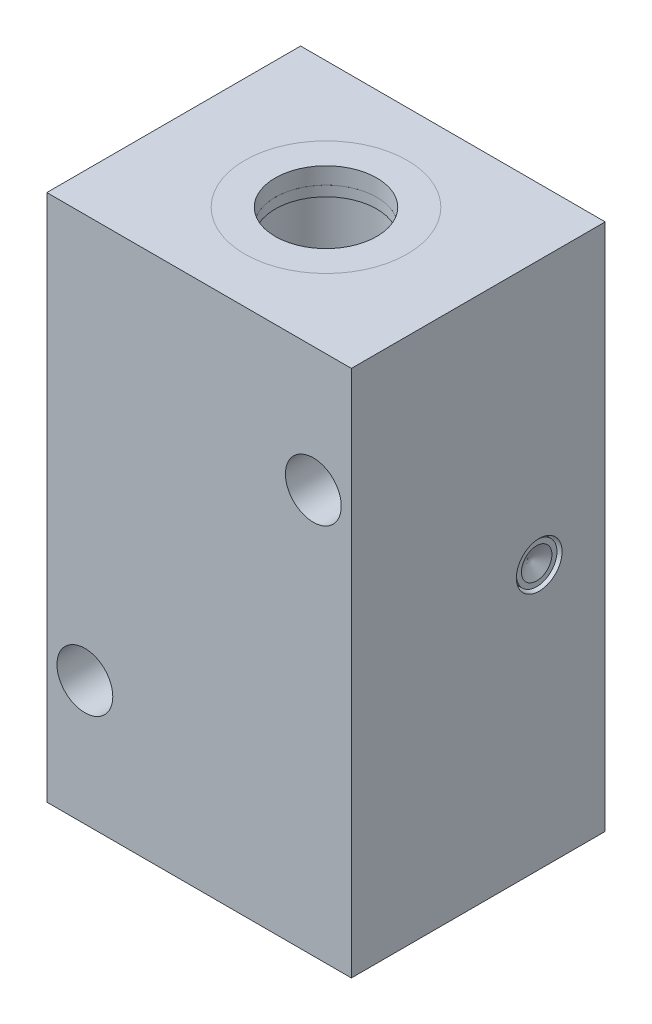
ISO-10303-21;
HEADER;
FILE_DESCRIPTION(('STEP AP214'),'2;1');
FILE_NAME('part.step','',(''),(''),'','','');
FILE_SCHEMA(('AUTOMOTIVE_DESIGN { 1 0 10303 214 1 1 1 1 }'));
ENDSEC;
DATA;
#1=APPLICATION_CONTEXT('core data for automotive mechanical design processes');
#2=APPLICATION_PROTOCOL_DEFINITION('international standard','automotive_design',2000,#1);
#3=PRODUCT_CONTEXT('',#1,'mechanical');
#4=PRODUCT('Part','Part','',(#3));
#5=PRODUCT_RELATED_PRODUCT_CATEGORY('part','',(#4));
#6=PRODUCT_DEFINITION_FORMATION('','',#4);
#7=PRODUCT_DEFINITION_CONTEXT('part definition',#1,'design');
#8=PRODUCT_DEFINITION('design','',#6,#7);
#9=PRODUCT_DEFINITION_SHAPE('','',#8);
#10=(LENGTH_UNIT() NAMED_UNIT(*) SI_UNIT(.MILLI.,.METRE.));
#11=(NAMED_UNIT(*) PLANE_ANGLE_UNIT() SI_UNIT($,.RADIAN.));
#12=(NAMED_UNIT(*) SI_UNIT($,.STERADIAN.) SOLID_ANGLE_UNIT());
#13=UNCERTAINTY_MEASURE_WITH_UNIT(LENGTH_MEASURE(1.E-05),#10,'distance_accuracy_value','');
#14=(GEOMETRIC_REPRESENTATION_CONTEXT(3) GLOBAL_UNCERTAINTY_ASSIGNED_CONTEXT((#13)) GLOBAL_UNIT_ASSIGNED_CONTEXT((#10,
#11,#12)) REPRESENTATION_CONTEXT('',''));
#15=CARTESIAN_POINT('',(0.,0.,0.));
#16=DIRECTION('',(0.,0.,1.));
#17=DIRECTION('',(1.,0.,0.));
#18=AXIS2_PLACEMENT_3D('',#15,#16,#17);
#19=CARTESIAN_POINT('',(1.88737914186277E-12,-48.6999999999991,0.));
#20=DIRECTION('',(0.,-1.,0.));
#21=DIRECTION('',(0.,0.,-1.));
#22=AXIS2_PLACEMENT_3D('',#19,#20,#21);
#23=PLANE('',#22);
#24=CARTESIAN_POINT('',(1.88737914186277E-12,-48.6999999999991,0.));
#25=DIRECTION('',(0.,-1.,0.));
#26=DIRECTION('',(0.,0.,-1.));
#27=AXIS2_PLACEMENT_3D('',#24,#25,#26);
#28=CIRCLE('',#27,16.);
#29=CARTESIAN_POINT('',(1.88737914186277E-12,-48.6999999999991,-16.));
#30=VERTEX_POINT('',#29);
#31=EDGE_CURVE('E65',#30,#30,#28,.T.);
#32=ORIENTED_EDGE('',*,*,#31,.F.);
#33=EDGE_LOOP('',(#32));
#34=FACE_BOUND('',#33,.T.);
#35=CARTESIAN_POINT('',(1.88737914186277E-12,-48.6999999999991,0.));
#36=DIRECTION('',(0.,-1.,0.));
#37=DIRECTION('',(0.,0.,-1.));
#38=AXIS2_PLACEMENT_3D('',#35,#36,#37);
#39=CIRCLE('',#38,10.);
#40=CARTESIAN_POINT('',(1.88737914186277E-12,-48.6999999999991,-10.));
#41=VERTEX_POINT('',#40);
#42=EDGE_CURVE('E77',#41,#41,#39,.T.);
#43=ORIENTED_EDGE('',*,*,#42,.T.);
#44=EDGE_LOOP('',(#43));
#45=FACE_BOUND('',#44,.T.);
#46=ADVANCED_FACE('F57',(#34,#45),#23,.F.);
#47=CARTESIAN_POINT('',(1.99840144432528E-12,-97.2548339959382,0.));
#48=DIRECTION('',(0.,1.,0.));
#49=DIRECTION('',(0.,0.,1.));
#50=AXIS2_PLACEMENT_3D('',#47,#48,#49);
#51=CYLINDRICAL_SURFACE('',#50,16.);
#52=CARTESIAN_POINT('',(1.88737914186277E-12,-51.9999999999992,0.));
#53=DIRECTION('',(0.,1.,0.));
#54=DIRECTION('',(0.,0.,1.));
#55=AXIS2_PLACEMENT_3D('',#52,#53,#54);
#56=CIRCLE('',#55,16.);
#57=CARTESIAN_POINT('',(1.88737914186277E-12,-51.9999999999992,16.));
#58=VERTEX_POINT('',#57);
#59=EDGE_CURVE('E71',#58,#58,#56,.T.);
#60=ORIENTED_EDGE('',*,*,#59,.T.);
#61=EDGE_LOOP('',(#60));
#62=FACE_BOUND('',#61,.T.);
#63=ORIENTED_EDGE('',*,*,#31,.T.);
#64=EDGE_LOOP('',(#63));
#65=FACE_BOUND('',#64,.T.);
#66=ADVANCED_FACE('F85',(#62,#65),#51,.T.);
#67=CARTESIAN_POINT('',(1.99840144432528E-12,-97.2548339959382,0.));
#68=DIRECTION('',(0.,1.,0.));
#69=DIRECTION('',(0.,0.,1.));
#70=AXIS2_PLACEMENT_3D('',#67,#68,#69);
#71=CYLINDRICAL_SURFACE('',#70,10.);
#72=CARTESIAN_POINT('',(1.88737914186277E-12,-51.9999999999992,0.));
#73=DIRECTION('',(0.,1.,0.));
#74=DIRECTION('',(0.,0.,1.));
#75=AXIS2_PLACEMENT_3D('',#72,#73,#74);
#76=CIRCLE('',#75,10.);
#77=CARTESIAN_POINT('',(1.88737914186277E-12,-51.9999999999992,10.));
#78=VERTEX_POINT('',#77);
#79=EDGE_CURVE('E11',#78,#78,#76,.T.);
#80=ORIENTED_EDGE('',*,*,#79,.F.);
#81=EDGE_LOOP('',(#80));
#82=FACE_BOUND('',#81,.T.);
#83=ORIENTED_EDGE('',*,*,#42,.F.);
#84=EDGE_LOOP('',(#83));
#85=FACE_BOUND('',#84,.T.);
#86=ADVANCED_FACE('F83',(#82,#85),#71,.F.);
#87=CARTESIAN_POINT('',(1.88737914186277E-12,-51.9999999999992,0.));
#88=DIRECTION('',(0.,1.,0.));
#89=DIRECTION('',(0.,0.,1.));
#90=AXIS2_PLACEMENT_3D('',#87,#88,#89);
#91=PLANE('',#90);
#92=ORIENTED_EDGE('',*,*,#79,.T.);
#93=EDGE_LOOP('',(#92));
#94=FACE_BOUND('',#93,.T.);
#95=ORIENTED_EDGE('',*,*,#59,.F.);
#96=EDGE_LOOP('',(#95));
#97=FACE_BOUND('',#96,.T.);
#98=ADVANCED_FACE('F59',(#94,#97),#91,.F.);
#99=CLOSED_SHELL('',(#46,#66,#86,#98));
#100=MANIFOLD_SOLID_BREP('B2',#99);
#101=CARTESIAN_POINT('',(0.,97.2548339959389,0.));
#102=DIRECTION('',(0.,-1.,0.));
#103=DIRECTION('',(1.,0.,0.));
#104=AXIS2_PLACEMENT_3D('',#101,#102,#103);
#105=CYLINDRICAL_SURFACE('',#104,16.);
#106=CARTESIAN_POINT('',(1.11022302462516E-13,48.7,0.));
#107=DIRECTION('',(0.,1.,0.));
#108=DIRECTION('',(-1.,0.,0.));
#109=AXIS2_PLACEMENT_3D('',#106,#107,#108);
#110=CIRCLE('',#109,16.);
#111=CARTESIAN_POINT('',(-15.9999999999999,48.7,0.));
#112=VERTEX_POINT('',#111);
#113=EDGE_CURVE('E143',#112,#112,#110,.T.);
#114=ORIENTED_EDGE('',*,*,#113,.T.);
#115=EDGE_LOOP('',(#114));
#116=FACE_BOUND('',#115,.T.);
#117=CARTESIAN_POINT('',(0.,51.9999999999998,0.));
#118=DIRECTION('',(0.,1.,0.));
#119=DIRECTION('',(0.,0.,1.));
#120=AXIS2_PLACEMENT_3D('',#117,#118,#119);
#121=CIRCLE('',#120,16.);
#122=CARTESIAN_POINT('',(0.,51.9999999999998,16.));
#123=VERTEX_POINT('',#122);
#124=EDGE_CURVE('E56',#123,#123,#121,.T.);
#125=ORIENTED_EDGE('',*,*,#124,.F.);
#126=EDGE_LOOP('',(#125));
#127=FACE_BOUND('',#126,.T.);
#128=ADVANCED_FACE('F135',(#116,#127),#105,.T.);
#129=CARTESIAN_POINT('',(1.11022302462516E-13,48.7,0.));
#130=DIRECTION('',(0.,1.,0.));
#131=DIRECTION('',(-1.,0.,0.));
#132=AXIS2_PLACEMENT_3D('',#129,#130,#131);
#133=PLANE('',#132);
#134=ORIENTED_EDGE('',*,*,#113,.F.);
#135=EDGE_LOOP('',(#134));
#136=FACE_BOUND('',#135,.T.);
#137=CARTESIAN_POINT('',(1.11022302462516E-13,48.7,0.));
#138=DIRECTION('',(0.,1.,0.));
#139=DIRECTION('',(-1.,0.,0.));
#140=AXIS2_PLACEMENT_3D('',#137,#138,#139);
#141=CIRCLE('',#140,10.);
#142=CARTESIAN_POINT('',(-9.99999999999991,48.7,0.));
#143=VERTEX_POINT('',#142);
#144=EDGE_CURVE('E150',#143,#143,#141,.T.);
#145=ORIENTED_EDGE('',*,*,#144,.T.);
#146=EDGE_LOOP('',(#145));
#147=FACE_BOUND('',#146,.T.);
#148=ADVANCED_FACE('F167',(#136,#147),#133,.F.);
#149=CARTESIAN_POINT('',(0.,97.2548339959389,0.));
#150=DIRECTION('',(0.,-1.,0.));
#151=DIRECTION('',(1.,0.,0.));
#152=AXIS2_PLACEMENT_3D('',#149,#150,#151);
#153=CYLINDRICAL_SURFACE('',#152,10.);
#154=ORIENTED_EDGE('',*,*,#144,.F.);
#155=EDGE_LOOP('',(#154));
#156=FACE_BOUND('',#155,.T.);
#157=CARTESIAN_POINT('',(0.,51.9999999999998,0.));
#158=DIRECTION('',(0.,1.,0.));
#159=DIRECTION('',(0.,0.,1.));
#160=AXIS2_PLACEMENT_3D('',#157,#158,#159);
#161=CIRCLE('',#160,10.);
#162=CARTESIAN_POINT('',(0.,51.9999999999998,10.));
#163=VERTEX_POINT('',#162);
#164=EDGE_CURVE('E138',#163,#163,#161,.T.);
#165=ORIENTED_EDGE('',*,*,#164,.T.);
#166=EDGE_LOOP('',(#165));
#167=FACE_BOUND('',#166,.T.);
#168=ADVANCED_FACE('F159',(#156,#167),#153,.F.);
#169=CARTESIAN_POINT('',(0.,51.9999999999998,0.));
#170=DIRECTION('',(0.,1.,0.));
#171=DIRECTION('',(0.,0.,1.));
#172=AXIS2_PLACEMENT_3D('',#169,#170,#171);
#173=PLANE('',#172);
#174=ORIENTED_EDGE('',*,*,#164,.F.);
#175=EDGE_LOOP('',(#174));
#176=FACE_BOUND('',#175,.T.);
#177=ORIENTED_EDGE('',*,*,#124,.T.);
#178=EDGE_LOOP('',(#177));
#179=FACE_BOUND('',#178,.T.);
#180=ADVANCED_FACE('F161',(#176,#179),#173,.T.);
#181=CLOSED_SHELL('',(#128,#148,#168,#180));
#182=MANIFOLD_SOLID_BREP('B6',#181);
#183=CARTESIAN_POINT('',(0.,5.69999999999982,0.));
#184=DIRECTION('',(0.,1.,0.));
#185=DIRECTION('',(0.,0.,1.));
#186=AXIS2_PLACEMENT_3D('',#183,#184,#185);
#187=CYLINDRICAL_SURFACE('',#186,10.5);
#188=CARTESIAN_POINT('',(0.,5.69999999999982,0.));
#189=DIRECTION('',(0.,1.,0.));
#190=DIRECTION('',(0.,0.,-1.));
#191=AXIS2_PLACEMENT_3D('',#188,#189,#190);
#192=CIRCLE('',#191,10.5);
#193=CARTESIAN_POINT('',(0.,5.69999999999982,-10.5));
#194=VERTEX_POINT('',#193);
#195=EDGE_CURVE('E562',#194,#194,#192,.T.);
#196=ORIENTED_EDGE('',*,*,#195,.F.);
#197=EDGE_LOOP('',(#196));
#198=FACE_BOUND('',#197,.T.);
#199=CARTESIAN_POINT('',(0.,46.6999999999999,0.));
#200=DIRECTION('',(0.,1.,0.));
#201=DIRECTION('',(0.,0.,-1.));
#202=AXIS2_PLACEMENT_3D('',#199,#200,#201);
#203=CIRCLE('',#202,10.5);
#204=CARTESIAN_POINT('',(0.,46.6999999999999,-10.5));
#205=VERTEX_POINT('',#204);
#206=EDGE_CURVE('E547',#205,#205,#203,.T.);
#207=ORIENTED_EDGE('',*,*,#206,.T.);
#208=EDGE_LOOP('',(#207));
#209=FACE_BOUND('',#208,.T.);
#210=ADVANCED_FACE('F204',(#198,#209),#187,.F.);
#211=CARTESIAN_POINT('',(0.,5.69999999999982,0.));
#212=DIRECTION('',(0.,-1.,0.));
#213=DIRECTION('',(0.,0.,-1.));
#214=AXIS2_PLACEMENT_3D('',#211,#212,#213);
#215=PLANE('',#214);
#216=CARTESIAN_POINT('',(0.,5.69999999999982,0.));
#217=DIRECTION('',(0.,-1.,0.));
#218=DIRECTION('',(0.,0.,-1.));
#219=AXIS2_PLACEMENT_3D('',#216,#217,#218);
#220=CIRCLE('',#219,10.);
#221=CARTESIAN_POINT('',(0.,5.69999999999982,-10.));
#222=VERTEX_POINT('',#221);
#223=EDGE_CURVE('E336',#222,#222,#220,.T.);
#224=ORIENTED_EDGE('',*,*,#223,.T.);
#225=EDGE_LOOP('',(#224));
#226=FACE_BOUND('',#225,.T.);
#227=ORIENTED_EDGE('',*,*,#195,.T.);
#228=EDGE_LOOP('',(#227));
#229=FACE_BOUND('',#228,.T.);
#230=ADVANCED_FACE('F431',(#226,#229),#215,.F.);
#231=CARTESIAN_POINT('',(0.,46.6999999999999,0.));
#232=DIRECTION('',(0.,-1.,0.));
#233=DIRECTION('',(0.,0.,-1.));
#234=AXIS2_PLACEMENT_3D('',#231,#232,#233);
#235=PLANE('',#234);
#236=CARTESIAN_POINT('',(0.,46.6999999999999,0.));
#237=DIRECTION('',(0.,-1.,0.));
#238=DIRECTION('',(1.,0.,0.));
#239=AXIS2_PLACEMENT_3D('',#236,#237,#238);
#240=CIRCLE('',#239,10.);
#241=CARTESIAN_POINT('',(10.,46.6999999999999,0.));
#242=VERTEX_POINT('',#241);
#243=EDGE_CURVE('E537',#242,#242,#240,.T.);
#244=ORIENTED_EDGE('',*,*,#243,.F.);
#245=EDGE_LOOP('',(#244));
#246=FACE_BOUND('',#245,.T.);
#247=ORIENTED_EDGE('',*,*,#206,.F.);
#248=EDGE_LOOP('',(#247));
#249=FACE_BOUND('',#248,.T.);
#250=ADVANCED_FACE('F437',(#246,#249),#235,.T.);
#251=CARTESIAN_POINT('',(0.,51.9999999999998,0.));
#252=DIRECTION('',(0.,-1.,0.));
#253=DIRECTION('',(1.,0.,0.));
#254=AXIS2_PLACEMENT_3D('',#251,#252,#253);
#255=CYLINDRICAL_SURFACE('',#254,16.);
#256=CARTESIAN_POINT('',(0.,51.9999999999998,0.));
#257=DIRECTION('',(0.,-1.,0.));
#258=DIRECTION('',(1.,0.,0.));
#259=AXIS2_PLACEMENT_3D('',#256,#257,#258);
#260=CIRCLE('',#259,16.);
#261=CARTESIAN_POINT('',(16.,51.9999999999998,0.));
#262=VERTEX_POINT('',#261);
#263=EDGE_CURVE('E520',#262,#262,#260,.T.);
#264=ORIENTED_EDGE('',*,*,#263,.F.);
#265=EDGE_LOOP('',(#264));
#266=FACE_BOUND('',#265,.T.);
#267=CARTESIAN_POINT('',(1.11022302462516E-13,48.7,0.));
#268=DIRECTION('',(0.,-1.,0.));
#269=DIRECTION('',(1.,0.,0.));
#270=AXIS2_PLACEMENT_3D('',#267,#268,#269);
#271=CIRCLE('',#270,16.);
#272=CARTESIAN_POINT('',(16.0000000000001,48.7,0.));
#273=VERTEX_POINT('',#272);
#274=EDGE_CURVE('E283',#273,#273,#271,.T.);
#275=ORIENTED_EDGE('',*,*,#274,.T.);
#276=EDGE_LOOP('',(#275));
#277=FACE_BOUND('',#276,.T.);
#278=ADVANCED_FACE('F642',(#266,#277),#255,.F.);
#279=CARTESIAN_POINT('',(0.,51.9999999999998,0.));
#280=DIRECTION('',(0.,-1.,0.));
#281=DIRECTION('',(1.,0.,0.));
#282=AXIS2_PLACEMENT_3D('',#279,#280,#281);
#283=CYLINDRICAL_SURFACE('',#282,10.);
#284=CARTESIAN_POINT('',(1.11022302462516E-13,48.7,0.));
#285=DIRECTION('',(0.,-1.,0.));
#286=DIRECTION('',(1.,0.,0.));
#287=AXIS2_PLACEMENT_3D('',#284,#285,#286);
#288=CIRCLE('',#287,10.);
#289=CARTESIAN_POINT('',(10.0000000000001,48.7,0.));
#290=VERTEX_POINT('',#289);
#291=EDGE_CURVE('E536',#290,#290,#288,.T.);
#292=ORIENTED_EDGE('',*,*,#291,.F.);
#293=EDGE_LOOP('',(#292));
#294=FACE_BOUND('',#293,.T.);
#295=ORIENTED_EDGE('',*,*,#243,.T.);
#296=EDGE_LOOP('',(#295));
#297=FACE_BOUND('',#296,.T.);
#298=ADVANCED_FACE('F638',(#294,#297),#283,.F.);
#299=CARTESIAN_POINT('',(10.0000000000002,48.6999999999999,0.));
#300=DIRECTION('',(0.,-1.,0.));
#301=DIRECTION('',(1.,0.,0.));
#302=AXIS2_PLACEMENT_3D('',#299,#300,#301);
#303=PLANE('',#302);
#304=ORIENTED_EDGE('',*,*,#274,.F.);
#305=EDGE_LOOP('',(#304));
#306=FACE_BOUND('',#305,.T.);
#307=ORIENTED_EDGE('',*,*,#291,.T.);
#308=EDGE_LOOP('',(#307));
#309=FACE_BOUND('',#308,.T.);
#310=ADVANCED_FACE('F422',(#306,#309),#303,.F.);
#311=CARTESIAN_POINT('',(1.88737914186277E-12,-51.9999999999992,0.));
#312=DIRECTION('',(0.,1.,0.));
#313=DIRECTION('',(0.,0.,1.));
#314=AXIS2_PLACEMENT_3D('',#311,#312,#313);
#315=PLANE('',#314);
#316=DIRECTION('',(1.,0.,0.));
#317=VECTOR('',#316,1.);
#318=CARTESIAN_POINT('',(1.88737914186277E-12,-51.9999999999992,-25.));
#319=LINE('',#318,#317);
#320=CARTESIAN_POINT('',(30.0000000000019,-52.0000000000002,-25.0000000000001));
#321=VERTEX_POINT('',#320);
#322=CARTESIAN_POINT('',(-29.9999999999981,-51.9999999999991,-25.));
#323=VERTEX_POINT('',#322);
#324=EDGE_CURVE('E493',#321,#323,#319,.F.);
#325=ORIENTED_EDGE('',*,*,#324,.F.);
#326=DIRECTION('',(0.,0.,1.));
#327=VECTOR('',#326,1.);
#328=CARTESIAN_POINT('',(30.0000000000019,-51.9999999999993,0.));
#329=LINE('',#328,#327);
#330=CARTESIAN_POINT('',(30.0000000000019,-52.0000000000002,25.));
#331=VERTEX_POINT('',#330);
#332=EDGE_CURVE('E500',#331,#321,#329,.F.);
#333=ORIENTED_EDGE('',*,*,#332,.F.);
#334=DIRECTION('',(1.,0.,0.));
#335=VECTOR('',#334,1.);
#336=CARTESIAN_POINT('',(-21.9999999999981,-52.,25.));
#337=LINE('',#336,#335);
#338=CARTESIAN_POINT('',(-29.9999999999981,-52.,25.));
#339=VERTEX_POINT('',#338);
#340=EDGE_CURVE('E567',#339,#331,#337,.T.);
#341=ORIENTED_EDGE('',*,*,#340,.F.);
#342=DIRECTION('',(0.,0.,1.));
#343=VECTOR('',#342,1.);
#344=CARTESIAN_POINT('',(-29.9999999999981,-51.9999999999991,-19.));
#345=LINE('',#344,#343);
#346=EDGE_CURVE('E576',#323,#339,#345,.T.);
#347=ORIENTED_EDGE('',*,*,#346,.F.);
#348=EDGE_LOOP('',(#325,#333,#341,#347));
#349=FACE_BOUND('',#348,.T.);
#350=CARTESIAN_POINT('',(1.88737914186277E-12,-51.9999999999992,0.));
#351=DIRECTION('',(0.,-1.,0.));
#352=DIRECTION('',(0.,0.,-1.));
#353=AXIS2_PLACEMENT_3D('',#350,#351,#352);
#354=CIRCLE('',#353,16.);
#355=CARTESIAN_POINT('',(1.88737914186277E-12,-51.9999999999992,-16.));
#356=VERTEX_POINT('',#355);
#357=EDGE_CURVE('E320',#356,#356,#354,.T.);
#358=ORIENTED_EDGE('',*,*,#357,.F.);
#359=EDGE_LOOP('',(#358));
#360=FACE_BOUND('',#359,.T.);
#361=ADVANCED_FACE('F420',(#349,#360),#315,.F.);
#362=CARTESIAN_POINT('',(0.,51.9999999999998,0.));
#363=DIRECTION('',(0.,1.,0.));
#364=DIRECTION('',(0.,0.,1.));
#365=AXIS2_PLACEMENT_3D('',#362,#363,#364);
#366=PLANE('',#365);
#367=ORIENTED_EDGE('',*,*,#263,.T.);
#368=EDGE_LOOP('',(#367));
#369=FACE_BOUND('',#368,.T.);
#370=DIRECTION('',(0.,0.,1.));
#371=VECTOR('',#370,1.);
#372=CARTESIAN_POINT('',(30.0000000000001,52.,0.));
#373=LINE('',#372,#371);
#374=CARTESIAN_POINT('',(30.0000000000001,52.,25.));
#375=VERTEX_POINT('',#374);
#376=CARTESIAN_POINT('',(30.0000000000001,52.,-25.));
#377=VERTEX_POINT('',#376);
#378=EDGE_CURVE('E558',#375,#377,#373,.F.);
#379=ORIENTED_EDGE('',*,*,#378,.T.);
#380=DIRECTION('',(1.,0.,0.));
#381=VECTOR('',#380,1.);
#382=CARTESIAN_POINT('',(0.,51.9999999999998,-25.));
#383=LINE('',#382,#381);
#384=CARTESIAN_POINT('',(-30.,51.9999999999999,-25.));
#385=VERTEX_POINT('',#384);
#386=EDGE_CURVE('E529',#377,#385,#383,.F.);
#387=ORIENTED_EDGE('',*,*,#386,.T.);
#388=DIRECTION('',(0.,0.,-1.));
#389=VECTOR('',#388,1.);
#390=CARTESIAN_POINT('',(-30.,51.9999999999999,-25.));
#391=LINE('',#390,#389);
#392=CARTESIAN_POINT('',(-30.,51.9999999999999,25.));
#393=VERTEX_POINT('',#392);
#394=EDGE_CURVE('E524',#393,#385,#391,.T.);
#395=ORIENTED_EDGE('',*,*,#394,.F.);
#396=DIRECTION('',(1.,0.,0.));
#397=VECTOR('',#396,1.);
#398=CARTESIAN_POINT('',(-22.,51.9999999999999,25.));
#399=LINE('',#398,#397);
#400=EDGE_CURVE('E214',#375,#393,#399,.F.);
#401=ORIENTED_EDGE('',*,*,#400,.F.);
#402=EDGE_LOOP('',(#379,#387,#395,#401));
#403=FACE_BOUND('',#402,.T.);
#404=ADVANCED_FACE('F418',(#369,#403),#366,.T.);
#405=CARTESIAN_POINT('',(30.0000000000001,52.,7.79999999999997));
#406=DIRECTION('',(1.,0.,0.));
#407=DIRECTION('',(0.,1.,0.));
#408=AXIS2_PLACEMENT_3D('',#405,#406,#407);
#409=PLANE('',#408);
#410=CARTESIAN_POINT('',(30.,-2.22044604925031E-13,-12.));
#411=DIRECTION('',(1.,0.,0.));
#412=DIRECTION('',(0.,0.,-1.));
#413=AXIS2_PLACEMENT_3D('',#410,#411,#412);
#414=CIRCLE('',#413,4.50000000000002);
#415=CARTESIAN_POINT('',(30.,-2.22044604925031E-13,-16.5));
#416=VERTEX_POINT('',#415);
#417=EDGE_CURVE('E516',#416,#416,#414,.T.);
#418=ORIENTED_EDGE('',*,*,#417,.F.);
#419=EDGE_LOOP('',(#418));
#420=FACE_BOUND('',#419,.T.);
#421=ORIENTED_EDGE('',*,*,#332,.T.);
#422=DIRECTION('',(0.,-1.,0.));
#423=VECTOR('',#422,1.);
#424=CARTESIAN_POINT('',(30.0000000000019,-52.0000000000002,-25.0000000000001));
#425=LINE('',#424,#423);
#426=EDGE_CURVE('E489',#377,#321,#425,.T.);
#427=ORIENTED_EDGE('',*,*,#426,.F.);
#428=ORIENTED_EDGE('',*,*,#378,.F.);
#429=DIRECTION('',(0.,-1.,0.));
#430=VECTOR('',#429,1.);
#431=CARTESIAN_POINT('',(30.0000000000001,96.7213595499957,25.0000000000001));
#432=LINE('',#431,#430);
#433=EDGE_CURVE('E287',#375,#331,#432,.T.);
#434=ORIENTED_EDGE('',*,*,#433,.T.);
#435=EDGE_LOOP('',(#421,#427,#428,#434));
#436=FACE_BOUND('',#435,.T.);
#437=ADVANCED_FACE('F414',(#420,#436),#409,.T.);
#438=CARTESIAN_POINT('',(-19.0000000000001,51.9999999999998,-25.));
#439=DIRECTION('',(0.,0.,-1.));
#440=DIRECTION('',(-1.,0.,0.));
#441=AXIS2_PLACEMENT_3D('',#438,#439,#440);
#442=PLANE('',#441);
#443=ORIENTED_EDGE('',*,*,#426,.T.);
#444=ORIENTED_EDGE('',*,*,#324,.T.);
#445=DIRECTION('',(0.,-1.,0.));
#446=VECTOR('',#445,1.);
#447=CARTESIAN_POINT('',(-29.9999999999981,-51.9999999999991,-25.));
#448=LINE('',#447,#446);
#449=EDGE_CURVE('E564',#385,#323,#448,.T.);
#450=ORIENTED_EDGE('',*,*,#449,.F.);
#451=ORIENTED_EDGE('',*,*,#386,.F.);
#452=EDGE_LOOP('',(#443,#444,#450,#451));
#453=FACE_BOUND('',#452,.T.);
#454=CARTESIAN_POINT('',(-22.5,-27.499999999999,-24.9999999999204));
#455=DIRECTION('',(0.,0.,-1.));
#456=DIRECTION('',(0.,1.,0.));
#457=AXIS2_PLACEMENT_3D('',#454,#455,#456);
#458=CIRCLE('',#457,3.99900000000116);
#459=CARTESIAN_POINT('',(-26.4990000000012,-27.4999999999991,-24.9999999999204));
#460=VERTEX_POINT('',#459);
#461=CARTESIAN_POINT('',(-19.,-29.4344252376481,-24.999999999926));
#462=VERTEX_POINT('',#461);
#463=EDGE_CURVE('E491',#460,#462,#458,.F.);
#464=ORIENTED_EDGE('',*,*,#463,.T.);
#465=DIRECTION('',(0.,-1.,0.));
#466=VECTOR('',#465,1.);
#467=CARTESIAN_POINT('',(-19.0000000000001,96.7213595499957,-25.));
#468=LINE('',#467,#466);
#469=CARTESIAN_POINT('',(-18.9999999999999,-25.5655747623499,-24.999999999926));
#470=VERTEX_POINT('',#469);
#471=EDGE_CURVE('E288',#470,#462,#468,.T.);
#472=ORIENTED_EDGE('',*,*,#471,.F.);
#473=CARTESIAN_POINT('',(-22.5,-27.499999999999,-24.9999999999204));
#474=DIRECTION('',(0.,0.,-1.));
#475=DIRECTION('',(0.,1.,0.));
#476=AXIS2_PLACEMENT_3D('',#473,#474,#475);
#477=CIRCLE('',#476,3.99900000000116);
#478=EDGE_CURVE('E402',#470,#460,#477,.F.);
#479=ORIENTED_EDGE('',*,*,#478,.T.);
#480=EDGE_LOOP('',(#464,#472,#479));
#481=FACE_BOUND('',#480,.T.);
#482=DIRECTION('',(0.,-1.,0.));
#483=VECTOR('',#482,1.);
#484=CARTESIAN_POINT('',(19.,96.7213595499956,-25.));
#485=LINE('',#484,#483);
#486=CARTESIAN_POINT('',(19.0000000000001,29.4344252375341,-25.0000000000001));
#487=VERTEX_POINT('',#486);
#488=CARTESIAN_POINT('',(19.0000000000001,25.5655747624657,-25.0000000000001));
#489=VERTEX_POINT('',#488);
#490=EDGE_CURVE('E281',#487,#489,#485,.T.);
#491=ORIENTED_EDGE('',*,*,#490,.T.);
#492=CARTESIAN_POINT('',(22.5,27.5,-25.0000000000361));
#493=DIRECTION('',(0.,0.,-1.));
#494=DIRECTION('',(-1.,0.,0.));
#495=AXIS2_PLACEMENT_3D('',#492,#493,#494);
#496=CIRCLE('',#495,3.99899999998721);
#497=EDGE_CURVE('E271',#487,#489,#496,.T.);
#498=ORIENTED_EDGE('',*,*,#497,.F.);
#499=EDGE_LOOP('',(#491,#498));
#500=FACE_BOUND('',#499,.T.);
#501=ADVANCED_FACE('F285',(#453,#481,#500),#442,.T.);
#502=CARTESIAN_POINT('',(-22.5,-27.499999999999,-24.9999999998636));
#503=DIRECTION('',(0.,0.,-1.));
#504=DIRECTION('',(0.,1.,0.));
#505=AXIS2_PLACEMENT_3D('',#502,#503,#504);
#506=CONICAL_SURFACE('',#505,3.99899999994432,0.785398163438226);
#507=DIRECTION('',(-0.707106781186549,0.,0.707106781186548));
#508=VECTOR('',#507,1.);
#509=CARTESIAN_POINT('',(498955.000000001,-27.4999999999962,-498998.501));
#510=LINE('',#509,#508);
#511=CARTESIAN_POINT('',(-19.0000000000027,-27.4999999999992,-24.5009999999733));
#512=VERTEX_POINT('',#511);
#513=CARTESIAN_POINT('',(-19.1000000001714,-27.4999999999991,-24.4009999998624));
#514=VERTEX_POINT('',#513);
#515=EDGE_CURVE('E480',#512,#514,#510,.T.);
#516=ORIENTED_EDGE('',*,*,#515,.T.);
#517=CARTESIAN_POINT('',(-22.5,-27.499999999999,-24.4009999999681));
#518=DIRECTION('',(0.,0.,-1.));
#519=DIRECTION('',(0.,1.,0.));
#520=AXIS2_PLACEMENT_3D('',#517,#518,#519);
#521=CIRCLE('',#520,3.39999999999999);
#522=CARTESIAN_POINT('',(-25.8999999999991,-27.499999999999,-24.4009999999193));
#523=VERTEX_POINT('',#522);
#524=EDGE_CURVE('E221',#514,#523,#521,.F.);
#525=ORIENTED_EDGE('',*,*,#524,.T.);
#526=DIRECTION('',(0.707106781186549,0.,0.707106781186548));
#527=VECTOR('',#526,1.);
#528=CARTESIAN_POINT('',(-499000.000000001,-27.5000000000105,-498998.501));
#529=LINE('',#528,#527);
#530=EDGE_CURVE('E477',#523,#460,#529,.F.);
#531=ORIENTED_EDGE('',*,*,#530,.T.);
#532=ORIENTED_EDGE('',*,*,#478,.F.);
#533=CARTESIAN_POINT('',(-19.,-27.4999999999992,-24.50099999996));
#534=CARTESIAN_POINT('',(-19.0000000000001,-27.4462535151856,-24.5009957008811));
#535=CARTESIAN_POINT('',(-19.0000000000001,-27.3925150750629,-24.5022386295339));
#536=CARTESIAN_POINT('',(-19.0000000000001,-27.2851592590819,-24.5071784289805));
#537=CARTESIAN_POINT('',(-19.0000000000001,-27.2315418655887,-24.5108749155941));
#538=CARTESIAN_POINT('',(-19.0000000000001,-27.0712107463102,-24.5255655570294));
#539=CARTESIAN_POINT('',(-19.0000000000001,-26.9648091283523,-24.5401612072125));
#540=CARTESIAN_POINT('',(-19.0000000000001,-26.7551985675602,-24.5779036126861));
#541=CARTESIAN_POINT('',(-19.0000000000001,-26.6519656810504,-24.6009209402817));
#542=CARTESIAN_POINT('',(-19.0000000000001,-26.4474613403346,-24.6545042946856));
#543=CARTESIAN_POINT('',(-19.0000000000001,-26.3461904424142,-24.6850724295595));
#544=CARTESIAN_POINT('',(-19.0000000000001,-26.1880975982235,-24.7383936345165));
#545=CARTESIAN_POINT('',(-19.0000000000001,-26.1305383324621,-24.7590073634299));
#546=CARTESIAN_POINT('',(-19.0000000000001,-26.0161680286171,-24.802178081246));
#547=CARTESIAN_POINT('',(-19.0000000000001,-25.9593568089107,-24.8247345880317));
#548=CARTESIAN_POINT('',(-19.0000000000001,-25.8459605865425,-24.8718087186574));
#549=CARTESIAN_POINT('',(-19.0000000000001,-25.7893821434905,-24.896342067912));
#550=CARTESIAN_POINT('',(-19.0000000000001,-25.6769441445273,-24.9470130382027));
#551=CARTESIAN_POINT('',(-19.0000000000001,-25.621084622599,-24.9731507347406));
#552=CARTESIAN_POINT('',(-19.0000000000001,-25.5655747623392,-24.9999999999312));
#553=B_SPLINE_CURVE_WITH_KNOTS('',3,(#533,#534,#535,#536,#537,#538,#539,#540,#541,#542,#543,
#544,#545,#546,#547,#548,#549,#550,#551,#552),.UNSPECIFIED.,.F.,.F.,(4,2,2,2,2,2,2,2,2,4),(0.,
0.161209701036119,0.322394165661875,0.644138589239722,0.961132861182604,1.27821573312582,
1.46160249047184,1.64494386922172,1.82992382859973,2.01491249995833),.UNSPECIFIED.);
#554=EDGE_CURVE('E394',#512,#470,#553,.T.);
#555=ORIENTED_EDGE('',*,*,#554,.F.);
#556=EDGE_LOOP('',(#516,#525,#531,#532,#555));
#557=FACE_BOUND('',#556,.T.);
#558=ADVANCED_FACE('F385',(#557),#506,.F.);
#559=CARTESIAN_POINT('',(-22.5,-27.499999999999,-24.9999999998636));
#560=DIRECTION('',(0.,0.,-1.));
#561=DIRECTION('',(0.,1.,0.));
#562=AXIS2_PLACEMENT_3D('',#559,#560,#561);
#563=CONICAL_SURFACE('',#562,3.99899999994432,0.785398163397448);
#564=ORIENTED_EDGE('',*,*,#530,.F.);
#565=CARTESIAN_POINT('',(-22.5,-27.499999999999,-24.4009999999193));
#566=DIRECTION('',(0.,0.,-1.));
#567=DIRECTION('',(0.,1.,0.));
#568=AXIS2_PLACEMENT_3D('',#565,#566,#567);
#569=CIRCLE('',#568,3.39999999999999);
#570=EDGE_CURVE('E133',#523,#514,#569,.F.);
#571=ORIENTED_EDGE('',*,*,#570,.T.);
#572=ORIENTED_EDGE('',*,*,#515,.F.);
#573=CARTESIAN_POINT('',(-19.0000000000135,-29.4344252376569,-24.9999999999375));
#574=CARTESIAN_POINT('',(-19.0000000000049,-29.299695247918,-24.9348720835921));
#575=CARTESIAN_POINT('',(-19.0000000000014,-29.1627411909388,-24.8737921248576));
#576=CARTESIAN_POINT('',(-18.9999999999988,-28.8836618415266,-24.7623790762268));
#577=CARTESIAN_POINT('',(-18.9999999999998,-28.7415115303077,-24.7121092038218));
#578=CARTESIAN_POINT('',(-19.0000000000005,-28.4567804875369,-24.6269522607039));
#579=CARTESIAN_POINT('',(-19.0000000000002,-28.3143167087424,-24.5916838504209));
#580=CARTESIAN_POINT('',(-19.,-28.0265752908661,-24.5375870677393));
#581=CARTESIAN_POINT('',(-19.0000000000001,-27.8813066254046,-24.5187130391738));
#582=CARTESIAN_POINT('',(-19.0000000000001,-27.696391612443,-24.5062856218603));
#583=CARTESIAN_POINT('',(-19.0000000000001,-27.6572258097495,-24.5043097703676));
#584=CARTESIAN_POINT('',(-19.0000000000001,-27.5787090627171,-24.5016651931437));
#585=CARTESIAN_POINT('',(-19.0000000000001,-27.53935795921,-24.5010011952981));
#586=CARTESIAN_POINT('',(-19.,-27.4999999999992,-24.5009999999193));
#587=B_SPLINE_CURVE_WITH_KNOTS('',3,(#573,#574,#575,#576,#577,#578,#579,#580,#581,#582,#583,
#584,#585,#586),.UNSPECIFIED.,.F.,.F.,(4,2,2,2,2,2,4),(0.,0.449237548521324,0.901034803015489,
1.340538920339,1.77881511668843,1.89644663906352,2.01450133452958),.UNSPECIFIED.);
#588=EDGE_CURVE('E403',#462,#512,#587,.T.);
#589=ORIENTED_EDGE('',*,*,#588,.F.);
#590=ORIENTED_EDGE('',*,*,#463,.F.);
#591=EDGE_LOOP('',(#564,#571,#572,#589,#590));
#592=FACE_BOUND('',#591,.T.);
#593=ADVANCED_FACE('F389',(#592),#563,.F.);
#594=CARTESIAN_POINT('',(-22.,51.9999999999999,25.));
#595=DIRECTION('',(0.,0.,1.));
#596=DIRECTION('',(0.,-1.,0.));
#597=AXIS2_PLACEMENT_3D('',#594,#595,#596);
#598=PLANE('',#597);
#599=CARTESIAN_POINT('',(-22.5,-27.5,25.));
#600=DIRECTION('',(0.,0.,1.));
#601=DIRECTION('',(1.,0.,0.));
#602=AXIS2_PLACEMENT_3D('',#599,#600,#601);
#603=CIRCLE('',#602,5.5);
#604=CARTESIAN_POINT('',(-17.,-27.5,25.));
#605=VERTEX_POINT('',#604);
#606=EDGE_CURVE('E463',#605,#605,#603,.T.);
#607=ORIENTED_EDGE('',*,*,#606,.F.);
#608=EDGE_LOOP('',(#607));
#609=FACE_BOUND('',#608,.T.);
#610=CARTESIAN_POINT('',(22.5,27.5,25.));
#611=DIRECTION('',(0.,0.,1.));
#612=DIRECTION('',(1.,0.,0.));
#613=AXIS2_PLACEMENT_3D('',#610,#611,#612);
#614=CIRCLE('',#613,5.5);
#615=CARTESIAN_POINT('',(28.,27.5,25.));
#616=VERTEX_POINT('',#615);
#617=EDGE_CURVE('E301',#616,#616,#614,.T.);
#618=ORIENTED_EDGE('',*,*,#617,.F.);
#619=EDGE_LOOP('',(#618));
#620=FACE_BOUND('',#619,.T.);
#621=ORIENTED_EDGE('',*,*,#433,.F.);
#622=ORIENTED_EDGE('',*,*,#400,.T.);
#623=DIRECTION('',(0.,-1.,0.));
#624=VECTOR('',#623,1.);
#625=CARTESIAN_POINT('',(-30.,96.7213595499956,25.));
#626=LINE('',#625,#624);
#627=EDGE_CURVE('E294',#393,#339,#626,.T.);
#628=ORIENTED_EDGE('',*,*,#627,.T.);
#629=ORIENTED_EDGE('',*,*,#340,.T.);
#630=EDGE_LOOP('',(#621,#622,#628,#629));
#631=FACE_BOUND('',#630,.T.);
#632=ADVANCED_FACE('F206',(#609,#620,#631),#598,.T.);
#633=CARTESIAN_POINT('',(-30.,51.9999999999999,-25.));
#634=DIRECTION('',(1.,0.,0.));
#635=DIRECTION('',(0.,0.,-1.));
#636=AXIS2_PLACEMENT_3D('',#633,#634,#635);
#637=PLANE('',#636);
#638=ORIENTED_EDGE('',*,*,#449,.T.);
#639=ORIENTED_EDGE('',*,*,#346,.T.);
#640=ORIENTED_EDGE('',*,*,#627,.F.);
#641=ORIENTED_EDGE('',*,*,#394,.T.);
#642=EDGE_LOOP('',(#638,#639,#640,#641));
#643=FACE_BOUND('',#642,.T.);
#644=ADVANCED_FACE('F383',(#643),#637,.F.);
#645=CARTESIAN_POINT('',(-22.5,-27.499999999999,12.));
#646=DIRECTION('',(0.,0.,1.));
#647=DIRECTION('',(1.,0.,0.));
#648=AXIS2_PLACEMENT_3D('',#645,#646,#647);
#649=CYLINDRICAL_SURFACE('',#648,3.30000000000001);
#650=CARTESIAN_POINT('',(-22.5,-27.499999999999,-3.18991393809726));
#651=DIRECTION('',(0.,0.,-1.));
#652=DIRECTION('',(0.,1.,0.));
#653=AXIS2_PLACEMENT_3D('',#650,#651,#652);
#654=CIRCLE('',#653,3.30000000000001);
#655=CARTESIAN_POINT('',(-22.5,-24.199999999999,-3.18991393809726));
#656=VERTEX_POINT('',#655);
#657=EDGE_CURVE('E316',#656,#656,#654,.T.);
#658=ORIENTED_EDGE('',*,*,#657,.T.);
#659=EDGE_LOOP('',(#658));
#660=FACE_BOUND('',#659,.T.);
#661=CARTESIAN_POINT('',(-22.5,-27.499999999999,16.));
#662=DIRECTION('',(0.,0.,1.));
#663=DIRECTION('',(1.,0.,0.));
#664=AXIS2_PLACEMENT_3D('',#661,#662,#663);
#665=CIRCLE('',#664,3.30000000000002);
#666=CARTESIAN_POINT('',(-19.1999999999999,-27.499999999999,16.));
#667=VERTEX_POINT('',#666);
#668=EDGE_CURVE('E460',#667,#667,#665,.T.);
#669=ORIENTED_EDGE('',*,*,#668,.T.);
#670=EDGE_LOOP('',(#669));
#671=FACE_BOUND('',#670,.T.);
#672=ADVANCED_FACE('F443',(#660,#671),#649,.F.);
#673=CARTESIAN_POINT('',(27.5,0.,-12.));
#674=DIRECTION('',(-1.,0.,0.));
#675=DIRECTION('',(0.,0.,1.));
#676=AXIS2_PLACEMENT_3D('',#673,#674,#675);
#677=PLANE('',#676);
#678=CARTESIAN_POINT('',(27.5,0.,-12.));
#679=DIRECTION('',(1.,0.,0.));
#680=DIRECTION('',(0.,1.,0.));
#681=AXIS2_PLACEMENT_3D('',#678,#679,#680);
#682=CIRCLE('',#681,4.);
#683=CARTESIAN_POINT('',(27.5,4.,-12.));
#684=VERTEX_POINT('',#683);
#685=EDGE_CURVE('E277',#684,#684,#682,.T.);
#686=ORIENTED_EDGE('',*,*,#685,.F.);
#687=EDGE_LOOP('',(#686));
#688=FACE_BOUND('',#687,.T.);
#689=CARTESIAN_POINT('',(27.5,0.,-12.));
#690=DIRECTION('',(1.,0.,0.));
#691=DIRECTION('',(0.,0.,-1.));
#692=AXIS2_PLACEMENT_3D('',#689,#690,#691);
#693=CIRCLE('',#692,4.50000000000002);
#694=CARTESIAN_POINT('',(27.5,0.,-16.5));
#695=VERTEX_POINT('',#694);
#696=EDGE_CURVE('E519',#695,#695,#693,.T.);
#697=ORIENTED_EDGE('',*,*,#696,.T.);
#698=EDGE_LOOP('',(#697));
#699=FACE_BOUND('',#698,.T.);
#700=ADVANCED_FACE('F445',(#688,#699),#677,.F.);
#701=CARTESIAN_POINT('',(30.,-2.22044604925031E-13,-12.));
#702=DIRECTION('',(1.,0.,0.));
#703=DIRECTION('',(0.,0.,-1.));
#704=AXIS2_PLACEMENT_3D('',#701,#702,#703);
#705=CYLINDRICAL_SURFACE('',#704,4.50000000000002);
#706=ORIENTED_EDGE('',*,*,#696,.F.);
#707=EDGE_LOOP('',(#706));
#708=FACE_BOUND('',#707,.T.);
#709=ORIENTED_EDGE('',*,*,#417,.T.);
#710=EDGE_LOOP('',(#709));
#711=FACE_BOUND('',#710,.T.);
#712=ADVANCED_FACE('F451',(#708,#711),#705,.F.);
#713=CARTESIAN_POINT('',(22.5,27.5,-25.0000000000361));
#714=DIRECTION('',(0.,0.,-1.));
#715=DIRECTION('',(-1.,0.,0.));
#716=AXIS2_PLACEMENT_3D('',#713,#714,#715);
#717=CONICAL_SURFACE('',#716,3.99899999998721,0.785398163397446);
#718=CARTESIAN_POINT('',(22.5,27.5,-24.4010000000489));
#719=DIRECTION('',(0.,0.,-1.));
#720=DIRECTION('',(-1.,0.,0.));
#721=AXIS2_PLACEMENT_3D('',#718,#719,#720);
#722=CIRCLE('',#721,3.39999999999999);
#723=CARTESIAN_POINT('',(19.1,27.5,-24.4010000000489));
#724=VERTEX_POINT('',#723);
#725=EDGE_CURVE('E317',#724,#724,#722,.F.);
#726=ORIENTED_EDGE('',*,*,#725,.T.);
#727=EDGE_LOOP('',(#726));
#728=FACE_BOUND('',#727,.T.);
#729=ORIENTED_EDGE('',*,*,#497,.T.);
#730=CARTESIAN_POINT('',(19.,23.410251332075,-26.3839401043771));
#731=CARTESIAN_POINT('',(19.,23.5095681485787,-26.3085001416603));
#732=CARTESIAN_POINT('',(19.,23.6094343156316,-26.2337717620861));
#733=CARTESIAN_POINT('',(19.,23.8104846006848,-26.0860588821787));
#734=CARTESIAN_POINT('',(19.,23.9116690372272,-26.0130748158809));
#735=CARTESIAN_POINT('',(19.,24.1163153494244,-25.8686519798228));
#736=CARTESIAN_POINT('',(19.,24.2197887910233,-25.7972295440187));
#737=CARTESIAN_POINT('',(19.,24.4284814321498,-25.6569908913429));
#738=CARTESIAN_POINT('',(19.,24.533700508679,-25.5881744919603));
#739=CARTESIAN_POINT('',(19.,24.7524499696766,-25.4497566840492));
#740=CARTESIAN_POINT('',(19.,24.8661038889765,-25.3803495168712));
#741=CARTESIAN_POINT('',(19.,25.0960706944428,-25.2460162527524));
#742=CARTESIAN_POINT('',(19.,25.2123840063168,-25.1810908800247));
#743=CARTESIAN_POINT('',(19.,25.447672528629,-25.0571163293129));
#744=CARTESIAN_POINT('',(19.,25.5666385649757,-24.9980498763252));
#745=CARTESIAN_POINT('',(19.,25.8078542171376,-24.8871158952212));
#746=CARTESIAN_POINT('',(19.0000000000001,25.9301022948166,-24.8352450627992));
#747=CARTESIAN_POINT('',(19.0000000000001,26.1673646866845,-24.7446568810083));
#748=CARTESIAN_POINT('',(19.,26.2820897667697,-24.705189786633));
#749=CARTESIAN_POINT('',(19.,26.5143541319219,-24.635451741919));
#750=CARTESIAN_POINT('',(19.,26.6318936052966,-24.6051814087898));
#751=CARTESIAN_POINT('',(19.,26.8671008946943,-24.5559395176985));
#752=CARTESIAN_POINT('',(19.,26.9847267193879,-24.5367706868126));
#753=CARTESIAN_POINT('',(19.,27.2213016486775,-24.5101133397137));
#754=CARTESIAN_POINT('',(19.0000000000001,27.3402505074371,-24.502622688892));
#755=CARTESIAN_POINT('',(19.0000000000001,27.5737056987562,-24.4999046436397));
#756=CARTESIAN_POINT('',(19.,27.6882067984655,-24.5042163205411));
#757=CARTESIAN_POINT('',(19.,27.9162570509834,-24.5238335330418));
#758=CARTESIAN_POINT('',(19.,28.0298061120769,-24.539140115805));
#759=CARTESIAN_POINT('',(19.,28.257051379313,-24.5801625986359));
#760=CARTESIAN_POINT('',(19.,28.3707146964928,-24.6060577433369));
#761=CARTESIAN_POINT('',(19.,28.5955569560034,-24.6668585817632));
#762=CARTESIAN_POINT('',(19.,28.7067360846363,-24.7017635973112));
#763=CARTESIAN_POINT('',(19.,28.9353529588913,-24.7822523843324));
#764=CARTESIAN_POINT('',(19.,29.0525637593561,-24.8284740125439));
#765=CARTESIAN_POINT('',(19.,29.2839362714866,-24.9280235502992));
#766=CARTESIAN_POINT('',(19.,29.3980969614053,-24.9813538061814));
#767=CARTESIAN_POINT('',(19.,29.6239438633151,-25.0938619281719));
#768=CARTESIAN_POINT('',(19.,29.7356207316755,-25.1530583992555));
#769=CARTESIAN_POINT('',(19.,29.9564084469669,-25.275989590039));
#770=CARTESIAN_POINT('',(19.,30.0655196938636,-25.3397235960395));
#771=CARTESIAN_POINT('',(19.,30.2761571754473,-25.4675869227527));
#772=CARTESIAN_POINT('',(19.,30.3777911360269,-25.5315397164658));
#773=CARTESIAN_POINT('',(19.,30.5793137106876,-25.6621466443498));
#774=CARTESIAN_POINT('',(19.,30.6792021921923,-25.728800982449));
#775=CARTESIAN_POINT('',(19.,30.8766545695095,-25.8637807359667));
#776=CARTESIAN_POINT('',(19.,30.9742307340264,-25.9320882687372));
#777=CARTESIAN_POINT('',(19.,31.1680476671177,-26.0705187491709));
#778=CARTESIAN_POINT('',(19.,31.2642887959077,-26.1406411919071));
#779=CARTESIAN_POINT('',(19.,31.3599705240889,-26.2115059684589));
#780=B_SPLINE_CURVE_WITH_KNOTS('',3,(#730,#731,#732,#733,#734,#735,#736,#737,#738,#739,#740,
#741,#742,#743,#744,#745,#746,#747,#748,#749,#750,#751,#752,#753,#754,#755,#756,#757,#758,#759,
#760,#761,#762,#763,#764,#765,#766,#767,#768,#769,#770,#771,#772,#773,#774,#775,#776,#777,#778,
#779),.UNSPECIFIED.,.F.,.F.,(4,2,2,2,2,2,2,2,2,2,2,2,2,2,2,2,2,2,2,2,2,2,2,2,4),(0.,
0.374166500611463,0.748425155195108,1.12558072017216,1.50270982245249,1.9021412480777,
2.30163706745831,2.69991758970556,3.09801460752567,3.46166868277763,3.82534715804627,
4.1823473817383,4.53928234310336,4.88247847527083,5.2257072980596,5.57500414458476,
5.92427470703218,6.30196787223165,6.67978601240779,7.05884329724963,7.43784109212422,
7.79803362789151,8.15825340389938,8.51555884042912,8.87276591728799),.UNSPECIFIED.);
#781=EDGE_CURVE('E227',#487,#489,#780,.F.);
#782=ORIENTED_EDGE('',*,*,#781,.F.);
#783=EDGE_LOOP('',(#729,#782));
#784=FACE_BOUND('',#783,.T.);
#785=ADVANCED_FACE('F272',(#728,#784),#717,.F.);
#786=CARTESIAN_POINT('',(22.5,27.5,12.));
#787=DIRECTION('',(0.,0.,-1.));
#788=DIRECTION('',(-1.,0.,0.));
#789=AXIS2_PLACEMENT_3D('',#786,#787,#788);
#790=CYLINDRICAL_SURFACE('',#789,3.30199999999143);
#791=CARTESIAN_POINT('',(22.5,27.5,-3.19111565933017));
#792=DIRECTION('',(0.,0.,-1.));
#793=DIRECTION('',(0.,1.,0.));
#794=AXIS2_PLACEMENT_3D('',#791,#792,#793);
#795=CIRCLE('',#794,3.30199999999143);
#796=CARTESIAN_POINT('',(22.5,30.8019999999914,-3.19111565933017));
#797=VERTEX_POINT('',#796);
#798=EDGE_CURVE('E311',#797,#797,#795,.T.);
#799=ORIENTED_EDGE('',*,*,#798,.T.);
#800=EDGE_LOOP('',(#799));
#801=FACE_BOUND('',#800,.T.);
#802=CARTESIAN_POINT('',(22.5,27.4999999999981,16.));
#803=DIRECTION('',(0.,0.,1.));
#804=DIRECTION('',(1.,0.,0.));
#805=AXIS2_PLACEMENT_3D('',#802,#803,#804);
#806=CIRCLE('',#805,3.30199999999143);
#807=CARTESIAN_POINT('',(25.8019999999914,27.4999999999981,16.));
#808=VERTEX_POINT('',#807);
#809=EDGE_CURVE('E208',#808,#808,#806,.T.);
#810=ORIENTED_EDGE('',*,*,#809,.T.);
#811=EDGE_LOOP('',(#810));
#812=FACE_BOUND('',#811,.T.);
#813=ADVANCED_FACE('F716',(#801,#812),#790,.F.);
#814=CARTESIAN_POINT('',(27.5,0.,-12.));
#815=DIRECTION('',(1.,0.,0.));
#816=DIRECTION('',(0.,1.,0.));
#817=AXIS2_PLACEMENT_3D('',#814,#815,#816);
#818=CYLINDRICAL_SURFACE('',#817,4.);
#819=ORIENTED_EDGE('',*,*,#685,.T.);
#820=EDGE_LOOP('',(#819));
#821=FACE_BOUND('',#820,.T.);
#822=CARTESIAN_POINT('',(29.5000000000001,-1.11022302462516E-13,-12.));
#823=DIRECTION('',(1.,0.,0.));
#824=DIRECTION('',(0.,1.,0.));
#825=AXIS2_PLACEMENT_3D('',#822,#823,#824);
#826=CIRCLE('',#825,4.);
#827=CARTESIAN_POINT('',(29.5000000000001,3.99999999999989,-12.));
#828=VERTEX_POINT('',#827);
#829=EDGE_CURVE('E364',#828,#828,#826,.T.);
#830=ORIENTED_EDGE('',*,*,#829,.F.);
#831=EDGE_LOOP('',(#830));
#832=FACE_BOUND('',#831,.T.);
#833=ADVANCED_FACE('F713',(#821,#832),#818,.T.);
#834=CARTESIAN_POINT('',(29.5000000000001,-1.11022302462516E-13,-12.));
#835=DIRECTION('',(1.,0.,0.));
#836=DIRECTION('',(0.,1.,0.));
#837=AXIS2_PLACEMENT_3D('',#834,#835,#836);
#838=PLANE('',#837);
#839=CARTESIAN_POINT('',(29.4999999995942,1.11022302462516E-13,-12.0000000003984));
#840=DIRECTION('',(-1.,0.,0.));
#841=DIRECTION('',(0.,-1.,0.));
#842=AXIS2_PLACEMENT_3D('',#839,#840,#841);
#843=CIRCLE('',#842,2.99999999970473);
#844=CARTESIAN_POINT('',(29.4999999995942,-2.99999999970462,-12.0000000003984));
#845=VERTEX_POINT('',#844);
#846=EDGE_CURVE('E360',#845,#845,#843,.T.);
#847=ORIENTED_EDGE('',*,*,#846,.T.);
#848=EDGE_LOOP('',(#847));
#849=FACE_BOUND('',#848,.T.);
#850=ORIENTED_EDGE('',*,*,#829,.T.);
#851=EDGE_LOOP('',(#850));
#852=FACE_BOUND('',#851,.T.);
#853=ADVANCED_FACE('F709',(#849,#852),#838,.T.);
#854=CARTESIAN_POINT('',(27.7679491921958,-2.22044604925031E-13,-12.0000000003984));
#855=DIRECTION('',(1.,0.,0.));
#856=DIRECTION('',(0.,1.,0.));
#857=AXIS2_PLACEMENT_3D('',#854,#855,#856);
#858=CONICAL_SURFACE('',#857,0.,1.0471975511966);
#859=ORIENTED_EDGE('',*,*,#846,.F.);
#860=EDGE_LOOP('',(#859));
#861=FACE_BOUND('',#860,.T.);
#862=CARTESIAN_POINT('',(27.7679491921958,-2.22044604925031E-13,-12.0000000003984));
#863=VERTEX_POINT('',#862);
#864=VERTEX_LOOP('',#863);
#865=FACE_BOUND('',#864,.T.);
#866=ADVANCED_FACE('F705',(#861,#865),#858,.F.);
#867=CARTESIAN_POINT('',(0.,5.69999999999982,0.));
#868=DIRECTION('',(0.,-1.,0.));
#869=DIRECTION('',(0.,0.,-1.));
#870=AXIS2_PLACEMENT_3D('',#867,#868,#869);
#871=CYLINDRICAL_SURFACE('',#870,10.);
#872=ORIENTED_EDGE('',*,*,#223,.F.);
#873=EDGE_LOOP('',(#872));
#874=FACE_BOUND('',#873,.T.);
#875=CARTESIAN_POINT('',(0.,3.69999999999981,0.));
#876=DIRECTION('',(0.,-1.,0.));
#877=DIRECTION('',(0.,0.,-1.));
#878=AXIS2_PLACEMENT_3D('',#875,#876,#877);
#879=CIRCLE('',#878,10.);
#880=CARTESIAN_POINT('',(0.,3.69999999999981,-10.));
#881=VERTEX_POINT('',#880);
#882=EDGE_CURVE('E356',#881,#881,#879,.T.);
#883=ORIENTED_EDGE('',*,*,#882,.T.);
#884=EDGE_LOOP('',(#883));
#885=FACE_BOUND('',#884,.T.);
#886=ADVANCED_FACE('F701',(#874,#885),#871,.F.);
#887=CARTESIAN_POINT('',(16.,3.6999999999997,0.));
#888=DIRECTION('',(0.,1.,0.));
#889=DIRECTION('',(0.,0.,1.));
#890=AXIS2_PLACEMENT_3D('',#887,#888,#889);
#891=PLANE('',#890);
#892=ORIENTED_EDGE('',*,*,#882,.F.);
#893=EDGE_LOOP('',(#892));
#894=FACE_BOUND('',#893,.T.);
#895=CARTESIAN_POINT('',(0.,3.69999999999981,0.));
#896=DIRECTION('',(0.,-1.,0.));
#897=DIRECTION('',(0.,0.,-1.));
#898=AXIS2_PLACEMENT_3D('',#895,#896,#897);
#899=CIRCLE('',#898,16.);
#900=CARTESIAN_POINT('',(0.,3.69999999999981,-16.));
#901=VERTEX_POINT('',#900);
#902=EDGE_CURVE('E352',#901,#901,#899,.T.);
#903=ORIENTED_EDGE('',*,*,#902,.T.);
#904=EDGE_LOOP('',(#903));
#905=FACE_BOUND('',#904,.T.);
#906=ADVANCED_FACE('F697',(#894,#905),#891,.F.);
#907=CARTESIAN_POINT('',(0.,5.69999999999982,0.));
#908=DIRECTION('',(0.,-1.,0.));
#909=DIRECTION('',(0.,0.,-1.));
#910=AXIS2_PLACEMENT_3D('',#907,#908,#909);
#911=CYLINDRICAL_SURFACE('',#910,16.);
#912=ORIENTED_EDGE('',*,*,#902,.F.);
#913=EDGE_LOOP('',(#912));
#914=FACE_BOUND('',#913,.T.);
#915=CARTESIAN_POINT('',(1.11022302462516E-13,-3.69999999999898,0.));
#916=DIRECTION('',(0.,-1.,0.));
#917=DIRECTION('',(0.,0.,-1.));
#918=AXIS2_PLACEMENT_3D('',#915,#916,#917);
#919=CIRCLE('',#918,16.);
#920=CARTESIAN_POINT('',(1.11022302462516E-13,-3.69999999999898,-16.));
#921=VERTEX_POINT('',#920);
#922=EDGE_CURVE('E348',#921,#921,#919,.T.);
#923=ORIENTED_EDGE('',*,*,#922,.T.);
#924=EDGE_LOOP('',(#923));
#925=FACE_BOUND('',#924,.T.);
#926=ADVANCED_FACE('F687',(#914,#925),#911,.F.);
#927=CARTESIAN_POINT('',(10.,-3.6999999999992,0.));
#928=DIRECTION('',(0.,-1.,0.));
#929=DIRECTION('',(0.,0.,-1.));
#930=AXIS2_PLACEMENT_3D('',#927,#928,#929);
#931=PLANE('',#930);
#932=ORIENTED_EDGE('',*,*,#922,.F.);
#933=EDGE_LOOP('',(#932));
#934=FACE_BOUND('',#933,.T.);
#935=CARTESIAN_POINT('',(1.11022302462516E-13,-3.69999999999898,0.));
#936=DIRECTION('',(0.,-1.,0.));
#937=DIRECTION('',(0.,0.,-1.));
#938=AXIS2_PLACEMENT_3D('',#935,#936,#937);
#939=CIRCLE('',#938,10.);
#940=CARTESIAN_POINT('',(1.11022302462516E-13,-3.69999999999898,-10.));
#941=VERTEX_POINT('',#940);
#942=EDGE_CURVE('E344',#941,#941,#939,.T.);
#943=ORIENTED_EDGE('',*,*,#942,.T.);
#944=EDGE_LOOP('',(#943));
#945=FACE_BOUND('',#944,.T.);
#946=ADVANCED_FACE('F676',(#934,#945),#931,.F.);
#947=CARTESIAN_POINT('',(0.,5.69999999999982,0.));
#948=DIRECTION('',(0.,-1.,0.));
#949=DIRECTION('',(0.,0.,-1.));
#950=AXIS2_PLACEMENT_3D('',#947,#948,#949);
#951=CYLINDRICAL_SURFACE('',#950,10.);
#952=ORIENTED_EDGE('',*,*,#942,.F.);
#953=EDGE_LOOP('',(#952));
#954=FACE_BOUND('',#953,.T.);
#955=CARTESIAN_POINT('',(1.11022302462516E-13,-5.6999999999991,0.));
#956=DIRECTION('',(0.,-1.,0.));
#957=DIRECTION('',(0.,0.,-1.));
#958=AXIS2_PLACEMENT_3D('',#955,#956,#957);
#959=CIRCLE('',#958,10.);
#960=CARTESIAN_POINT('',(1.11022302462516E-13,-5.6999999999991,-10.));
#961=VERTEX_POINT('',#960);
#962=EDGE_CURVE('E340',#961,#961,#959,.T.);
#963=ORIENTED_EDGE('',*,*,#962,.T.);
#964=EDGE_LOOP('',(#963));
#965=FACE_BOUND('',#964,.T.);
#966=ADVANCED_FACE('F671',(#954,#965),#951,.F.);
#967=CARTESIAN_POINT('',(1.88737914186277E-12,-46.6999999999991,0.));
#968=DIRECTION('',(0.,1.,0.));
#969=DIRECTION('',(0.,0.,1.));
#970=AXIS2_PLACEMENT_3D('',#967,#968,#969);
#971=CYLINDRICAL_SURFACE('',#970,10.5);
#972=CARTESIAN_POINT('',(1.88737914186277E-12,-46.6999999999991,0.));
#973=DIRECTION('',(0.,1.,0.));
#974=DIRECTION('',(0.,0.,-1.));
#975=AXIS2_PLACEMENT_3D('',#972,#973,#974);
#976=CIRCLE('',#975,10.5);
#977=CARTESIAN_POINT('',(1.88737914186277E-12,-46.6999999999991,-10.5));
#978=VERTEX_POINT('',#977);
#979=EDGE_CURVE('E545',#978,#978,#976,.T.);
#980=ORIENTED_EDGE('',*,*,#979,.F.);
#981=EDGE_LOOP('',(#980));
#982=FACE_BOUND('',#981,.T.);
#983=CARTESIAN_POINT('',(1.11022302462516E-13,-5.6999999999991,0.));
#984=DIRECTION('',(0.,1.,0.));
#985=DIRECTION('',(0.,0.,-1.));
#986=AXIS2_PLACEMENT_3D('',#983,#984,#985);
#987=CIRCLE('',#986,10.5);
#988=CARTESIAN_POINT('',(1.11022302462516E-13,-5.6999999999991,-10.5));
#989=VERTEX_POINT('',#988);
#990=EDGE_CURVE('E548',#989,#989,#987,.T.);
#991=ORIENTED_EDGE('',*,*,#990,.T.);
#992=EDGE_LOOP('',(#991));
#993=FACE_BOUND('',#992,.T.);
#994=ADVANCED_FACE('F664',(#982,#993),#971,.F.);
#995=CARTESIAN_POINT('',(1.88737914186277E-12,-46.6999999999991,0.));
#996=DIRECTION('',(0.,-1.,0.));
#997=DIRECTION('',(0.,0.,-1.));
#998=AXIS2_PLACEMENT_3D('',#995,#996,#997);
#999=PLANE('',#998);
#1000=CARTESIAN_POINT('',(1.88737914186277E-12,-46.6999999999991,0.));
#1001=DIRECTION('',(0.,-1.,0.));
#1002=DIRECTION('',(0.,0.,-1.));
#1003=AXIS2_PLACEMENT_3D('',#1000,#1001,#1002);
#1004=CIRCLE('',#1003,10.);
#1005=CARTESIAN_POINT('',(1.88737914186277E-12,-46.6999999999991,-10.));
#1006=VERTEX_POINT('',#1005);
#1007=EDGE_CURVE('E332',#1006,#1006,#1004,.T.);
#1008=ORIENTED_EDGE('',*,*,#1007,.T.);
#1009=EDGE_LOOP('',(#1008));
#1010=FACE_BOUND('',#1009,.T.);
#1011=ORIENTED_EDGE('',*,*,#979,.T.);
#1012=EDGE_LOOP('',(#1011));
#1013=FACE_BOUND('',#1012,.T.);
#1014=ADVANCED_FACE('F660',(#1010,#1013),#999,.F.);
#1015=CARTESIAN_POINT('',(1.11022302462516E-13,-5.6999999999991,0.));
#1016=DIRECTION('',(0.,-1.,0.));
#1017=DIRECTION('',(0.,0.,-1.));
#1018=AXIS2_PLACEMENT_3D('',#1015,#1016,#1017);
#1019=PLANE('',#1018);
#1020=ORIENTED_EDGE('',*,*,#962,.F.);
#1021=EDGE_LOOP('',(#1020));
#1022=FACE_BOUND('',#1021,.T.);
#1023=ORIENTED_EDGE('',*,*,#990,.F.);
#1024=EDGE_LOOP('',(#1023));
#1025=FACE_BOUND('',#1024,.T.);
#1026=ADVANCED_FACE('F663',(#1022,#1025),#1019,.T.);
#1027=CARTESIAN_POINT('',(1.88737914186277E-12,-51.9999999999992,0.));
#1028=DIRECTION('',(0.,-1.,0.));
#1029=DIRECTION('',(0.,0.,-1.));
#1030=AXIS2_PLACEMENT_3D('',#1027,#1028,#1029);
#1031=CYLINDRICAL_SURFACE('',#1030,10.);
#1032=ORIENTED_EDGE('',*,*,#1007,.F.);
#1033=EDGE_LOOP('',(#1032));
#1034=FACE_BOUND('',#1033,.T.);
#1035=CARTESIAN_POINT('',(1.88737914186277E-12,-48.6999999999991,0.));
#1036=DIRECTION('',(0.,-1.,0.));
#1037=DIRECTION('',(0.,0.,-1.));
#1038=AXIS2_PLACEMENT_3D('',#1035,#1036,#1037);
#1039=CIRCLE('',#1038,10.);
#1040=CARTESIAN_POINT('',(1.88737914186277E-12,-48.6999999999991,-10.));
#1041=VERTEX_POINT('',#1040);
#1042=EDGE_CURVE('E328',#1041,#1041,#1039,.T.);
#1043=ORIENTED_EDGE('',*,*,#1042,.T.);
#1044=EDGE_LOOP('',(#1043));
#1045=FACE_BOUND('',#1044,.T.);
#1046=ADVANCED_FACE('F668',(#1034,#1045),#1031,.F.);
#1047=CARTESIAN_POINT('',(10.000000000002,-48.6999999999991,0.));
#1048=DIRECTION('',(0.,1.,0.));
#1049=DIRECTION('',(0.,0.,1.));
#1050=AXIS2_PLACEMENT_3D('',#1047,#1048,#1049);
#1051=PLANE('',#1050);
#1052=ORIENTED_EDGE('',*,*,#1042,.F.);
#1053=EDGE_LOOP('',(#1052));
#1054=FACE_BOUND('',#1053,.T.);
#1055=CARTESIAN_POINT('',(1.88737914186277E-12,-48.6999999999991,0.));
#1056=DIRECTION('',(0.,-1.,0.));
#1057=DIRECTION('',(0.,0.,-1.));
#1058=AXIS2_PLACEMENT_3D('',#1055,#1056,#1057);
#1059=CIRCLE('',#1058,16.);
#1060=CARTESIAN_POINT('',(1.88737914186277E-12,-48.6999999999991,-16.));
#1061=VERTEX_POINT('',#1060);
#1062=EDGE_CURVE('E324',#1061,#1061,#1059,.T.);
#1063=ORIENTED_EDGE('',*,*,#1062,.T.);
#1064=EDGE_LOOP('',(#1063));
#1065=FACE_BOUND('',#1064,.T.);
#1066=ADVANCED_FACE('F760',(#1054,#1065),#1051,.F.);
#1067=CARTESIAN_POINT('',(1.88737914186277E-12,-51.9999999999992,0.));
#1068=DIRECTION('',(0.,-1.,0.));
#1069=DIRECTION('',(0.,0.,-1.));
#1070=AXIS2_PLACEMENT_3D('',#1067,#1068,#1069);
#1071=CYLINDRICAL_SURFACE('',#1070,16.);
#1072=ORIENTED_EDGE('',*,*,#1062,.F.);
#1073=EDGE_LOOP('',(#1072));
#1074=FACE_BOUND('',#1073,.T.);
#1075=ORIENTED_EDGE('',*,*,#357,.T.);
#1076=EDGE_LOOP('',(#1075));
#1077=FACE_BOUND('',#1076,.T.);
#1078=ADVANCED_FACE('F757',(#1074,#1077),#1071,.F.);
#1079=CARTESIAN_POINT('',(-22.5,-27.499999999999,-25.));
#1080=DIRECTION('',(0.,0.,-1.));
#1081=DIRECTION('',(0.,1.,0.));
#1082=AXIS2_PLACEMENT_3D('',#1079,#1080,#1081);
#1083=CYLINDRICAL_SURFACE('',#1082,3.39999999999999);
#1084=CARTESIAN_POINT('',(-22.5,-27.499999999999,-3.24999999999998));
#1085=DIRECTION('',(0.,0.,-1.));
#1086=DIRECTION('',(0.,1.,0.));
#1087=AXIS2_PLACEMENT_3D('',#1084,#1085,#1086);
#1088=CIRCLE('',#1087,3.39999999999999);
#1089=CARTESIAN_POINT('',(-22.5,-24.099999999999,-3.24999999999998));
#1090=VERTEX_POINT('',#1089);
#1091=EDGE_CURVE('E312',#1090,#1090,#1088,.T.);
#1092=ORIENTED_EDGE('',*,*,#1091,.F.);
#1093=EDGE_LOOP('',(#1092));
#1094=FACE_BOUND('',#1093,.T.);
#1095=ORIENTED_EDGE('',*,*,#570,.F.);
#1096=ORIENTED_EDGE('',*,*,#524,.F.);
#1097=EDGE_LOOP('',(#1095,#1096));
#1098=FACE_BOUND('',#1097,.T.);
#1099=ADVANCED_FACE('F753',(#1094,#1098),#1083,.F.);
#1100=CARTESIAN_POINT('',(-22.5,-27.499999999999,-3.24999999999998));
#1101=DIRECTION('',(0.,0.,-1.));
#1102=DIRECTION('',(0.,1.,0.));
#1103=AXIS2_PLACEMENT_3D('',#1100,#1101,#1102);
#1104=CONICAL_SURFACE('',#1103,3.39999999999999,1.02974425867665);
#1105=ORIENTED_EDGE('',*,*,#1091,.T.);
#1106=EDGE_LOOP('',(#1105));
#1107=FACE_BOUND('',#1106,.T.);
#1108=ORIENTED_EDGE('',*,*,#657,.F.);
#1109=EDGE_LOOP('',(#1108));
#1110=FACE_BOUND('',#1109,.T.);
#1111=ADVANCED_FACE('F749',(#1107,#1110),#1104,.F.);
#1112=CARTESIAN_POINT('',(22.5,27.5,-25.0000000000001));
#1113=DIRECTION('',(0.,0.,-1.));
#1114=DIRECTION('',(0.,1.,0.));
#1115=AXIS2_PLACEMENT_3D('',#1112,#1113,#1114);
#1116=CYLINDRICAL_SURFACE('',#1115,3.39999999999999);
#1117=CARTESIAN_POINT('',(22.5,27.5,-3.25000000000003));
#1118=DIRECTION('',(0.,0.,-1.));
#1119=DIRECTION('',(0.,1.,0.));
#1120=AXIS2_PLACEMENT_3D('',#1117,#1118,#1119);
#1121=CIRCLE('',#1120,3.39999999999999);
#1122=CARTESIAN_POINT('',(22.5,30.9,-3.25000000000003));
#1123=VERTEX_POINT('',#1122);
#1124=EDGE_CURVE('E307',#1123,#1123,#1121,.T.);
#1125=ORIENTED_EDGE('',*,*,#1124,.F.);
#1126=EDGE_LOOP('',(#1125));
#1127=FACE_BOUND('',#1126,.T.);
#1128=ORIENTED_EDGE('',*,*,#725,.F.);
#1129=EDGE_LOOP('',(#1128));
#1130=FACE_BOUND('',#1129,.T.);
#1131=ADVANCED_FACE('F745',(#1127,#1130),#1116,.F.);
#1132=CARTESIAN_POINT('',(22.5,27.5,-3.25000000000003));
#1133=DIRECTION('',(0.,0.,-1.));
#1134=DIRECTION('',(0.,1.,0.));
#1135=AXIS2_PLACEMENT_3D('',#1132,#1133,#1134);
#1136=CONICAL_SURFACE('',#1135,3.39999999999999,1.02974425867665);
#1137=ORIENTED_EDGE('',*,*,#1124,.T.);
#1138=EDGE_LOOP('',(#1137));
#1139=FACE_BOUND('',#1138,.T.);
#1140=ORIENTED_EDGE('',*,*,#798,.F.);
#1141=EDGE_LOOP('',(#1140));
#1142=FACE_BOUND('',#1141,.T.);
#1143=ADVANCED_FACE('F742',(#1139,#1142),#1136,.F.);
#1144=CARTESIAN_POINT('',(-19.0000000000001,96.7213595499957,-24.2000000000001));
#1145=DIRECTION('',(-1.,0.,0.));
#1146=DIRECTION('',(0.,0.,1.));
#1147=AXIS2_PLACEMENT_3D('',#1144,#1145,#1146);
#1148=PLANE('',#1147);
#1149=ORIENTED_EDGE('',*,*,#554,.T.);
#1150=ORIENTED_EDGE('',*,*,#471,.T.);
#1151=ORIENTED_EDGE('',*,*,#588,.T.);
#1152=EDGE_LOOP('',(#1149,#1150,#1151));
#1153=FACE_BOUND('',#1152,.T.);
#1154=ADVANCED_FACE('F507',(#1153),#1148,.T.);
#1155=CARTESIAN_POINT('',(19.,96.7213595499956,-25.));
#1156=DIRECTION('',(1.,0.,0.));
#1157=DIRECTION('',(0.,1.,0.));
#1158=AXIS2_PLACEMENT_3D('',#1155,#1156,#1157);
#1159=PLANE('',#1158);
#1160=ORIENTED_EDGE('',*,*,#781,.T.);
#1161=ORIENTED_EDGE('',*,*,#490,.F.);
#1162=EDGE_LOOP('',(#1160,#1161));
#1163=FACE_BOUND('',#1162,.T.);
#1164=ADVANCED_FACE('F280',(#1163),#1159,.T.);
#1165=CARTESIAN_POINT('',(22.5,27.4999999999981,16.));
#1166=DIRECTION('',(0.,0.,1.));
#1167=DIRECTION('',(1.,0.,0.));
#1168=AXIS2_PLACEMENT_3D('',#1165,#1166,#1167);
#1169=CYLINDRICAL_SURFACE('',#1168,5.5);
#1170=CARTESIAN_POINT('',(22.5,27.4999999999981,16.));
#1171=DIRECTION('',(0.,0.,1.));
#1172=DIRECTION('',(1.,0.,0.));
#1173=AXIS2_PLACEMENT_3D('',#1170,#1171,#1172);
#1174=CIRCLE('',#1173,5.5);
#1175=CARTESIAN_POINT('',(28.,27.4999999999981,16.));
#1176=VERTEX_POINT('',#1175);
#1177=EDGE_CURVE('E298',#1176,#1176,#1174,.T.);
#1178=ORIENTED_EDGE('',*,*,#1177,.F.);
#1179=EDGE_LOOP('',(#1178));
#1180=FACE_BOUND('',#1179,.T.);
#1181=ORIENTED_EDGE('',*,*,#617,.T.);
#1182=EDGE_LOOP('',(#1181));
#1183=FACE_BOUND('',#1182,.T.);
#1184=ADVANCED_FACE('F729',(#1180,#1183),#1169,.F.);
#1185=CARTESIAN_POINT('',(22.5,27.4999999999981,16.));
#1186=DIRECTION('',(0.,0.,1.));
#1187=DIRECTION('',(1.,0.,0.));
#1188=AXIS2_PLACEMENT_3D('',#1185,#1186,#1187);
#1189=PLANE('',#1188);
#1190=ORIENTED_EDGE('',*,*,#809,.F.);
#1191=EDGE_LOOP('',(#1190));
#1192=FACE_BOUND('',#1191,.T.);
#1193=ORIENTED_EDGE('',*,*,#1177,.T.);
#1194=EDGE_LOOP('',(#1193));
#1195=FACE_BOUND('',#1194,.T.);
#1196=ADVANCED_FACE('F597',(#1192,#1195),#1189,.T.);
#1197=CARTESIAN_POINT('',(-22.5,-27.499999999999,16.));
#1198=DIRECTION('',(0.,0.,1.));
#1199=DIRECTION('',(1.,0.,0.));
#1200=AXIS2_PLACEMENT_3D('',#1197,#1198,#1199);
#1201=CYLINDRICAL_SURFACE('',#1200,5.5);
#1202=CARTESIAN_POINT('',(-22.5,-27.499999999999,16.));
#1203=DIRECTION('',(0.,0.,1.));
#1204=DIRECTION('',(1.,0.,0.));
#1205=AXIS2_PLACEMENT_3D('',#1202,#1203,#1204);
#1206=CIRCLE('',#1205,5.5);
#1207=CARTESIAN_POINT('',(-17.,-27.499999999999,16.));
#1208=VERTEX_POINT('',#1207);
#1209=EDGE_CURVE('E466',#1208,#1208,#1206,.T.);
#1210=ORIENTED_EDGE('',*,*,#1209,.F.);
#1211=EDGE_LOOP('',(#1210));
#1212=FACE_BOUND('',#1211,.T.);
#1213=ORIENTED_EDGE('',*,*,#606,.T.);
#1214=EDGE_LOOP('',(#1213));
#1215=FACE_BOUND('',#1214,.T.);
#1216=ADVANCED_FACE('F594',(#1212,#1215),#1201,.F.);
#1217=CARTESIAN_POINT('',(-22.5,-27.499999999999,16.));
#1218=DIRECTION('',(0.,0.,1.));
#1219=DIRECTION('',(1.,0.,0.));
#1220=AXIS2_PLACEMENT_3D('',#1217,#1218,#1219);
#1221=PLANE('',#1220);
#1222=ORIENTED_EDGE('',*,*,#668,.F.);
#1223=EDGE_LOOP('',(#1222));
#1224=FACE_BOUND('',#1223,.T.);
#1225=ORIENTED_EDGE('',*,*,#1209,.T.);
#1226=EDGE_LOOP('',(#1225));
#1227=FACE_BOUND('',#1226,.T.);
#1228=ADVANCED_FACE('F592',(#1224,#1227),#1221,.T.);
#1229=CLOSED_SHELL('',(#210,#230,#250,#278,#298,#310,#361,#404,#437,#501,#558,#593,#632,#644,
#672,#700,#712,#785,#813,#833,#853,#866,#886,#906,#926,#946,#966,#994,#1014,#1026,#1046,#1066,
#1078,#1099,#1111,#1131,#1143,#1154,#1164,#1184,#1196,#1216,#1228));
#1230=MANIFOLD_SOLID_BREP('B51',#1229);
#1231=ADVANCED_BREP_SHAPE_REPRESENTATION('',(#18,#100,#182,#1230),#14);
#1232=SHAPE_DEFINITION_REPRESENTATION(#9,#1231);
ENDSEC;
END-ISO-10303-21;
